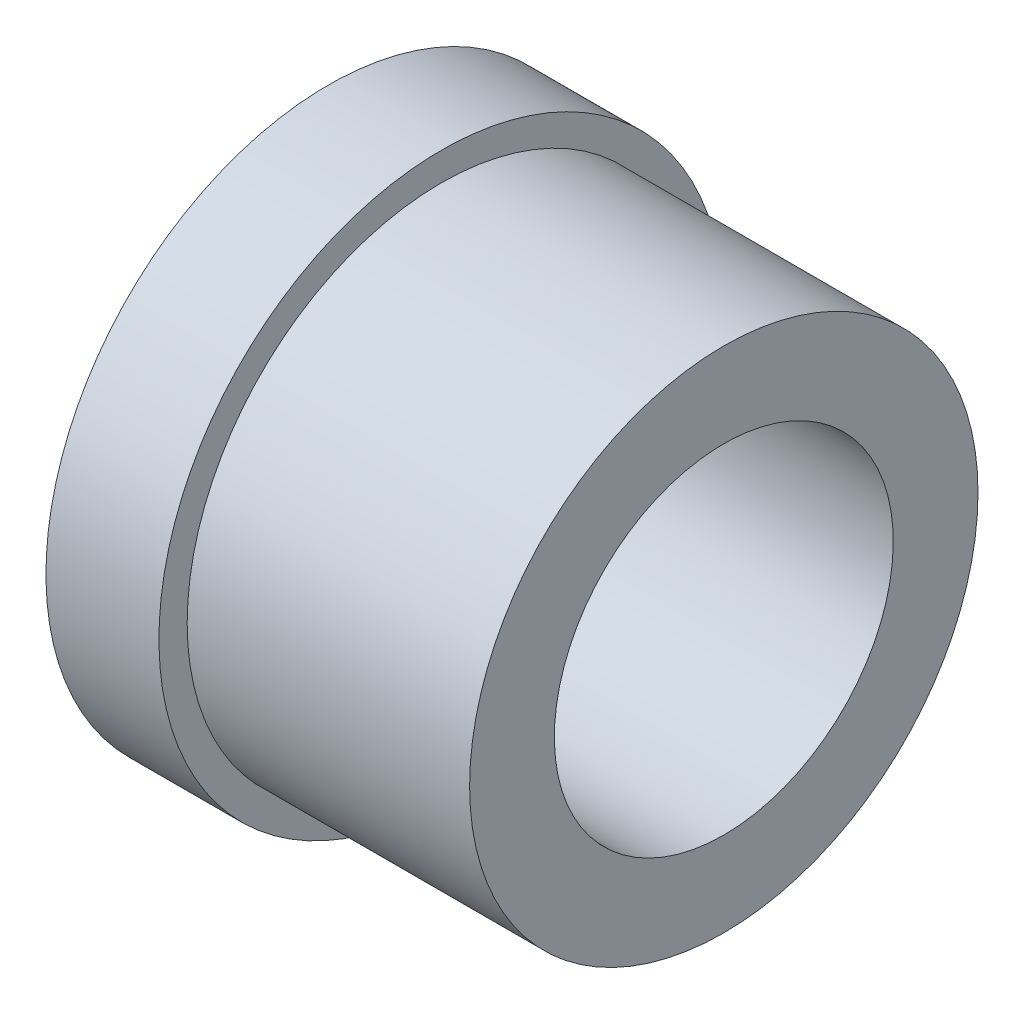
ISO-10303-21;
HEADER;
FILE_DESCRIPTION(('STEP AP214'),'2;1');
FILE_NAME('part.step','',(''),(''),'','','');
FILE_SCHEMA(('AUTOMOTIVE_DESIGN { 1 0 10303 214 1 1 1 1 }'));
ENDSEC;
DATA;
#1=APPLICATION_CONTEXT('core data for automotive mechanical design processes');
#2=APPLICATION_PROTOCOL_DEFINITION('international standard','automotive_design',2000,#1);
#3=PRODUCT_CONTEXT('',#1,'mechanical');
#4=PRODUCT('Part','Part','',(#3));
#5=PRODUCT_RELATED_PRODUCT_CATEGORY('part','',(#4));
#6=PRODUCT_DEFINITION_FORMATION('','',#4);
#7=PRODUCT_DEFINITION_CONTEXT('part definition',#1,'design');
#8=PRODUCT_DEFINITION('design','',#6,#7);
#9=PRODUCT_DEFINITION_SHAPE('','',#8);
#10=(LENGTH_UNIT() NAMED_UNIT(*) SI_UNIT(.MILLI.,.METRE.));
#11=(NAMED_UNIT(*) PLANE_ANGLE_UNIT() SI_UNIT($,.RADIAN.));
#12=(NAMED_UNIT(*) SI_UNIT($,.STERADIAN.) SOLID_ANGLE_UNIT());
#13=UNCERTAINTY_MEASURE_WITH_UNIT(LENGTH_MEASURE(1.E-05),#10,'distance_accuracy_value','');
#14=(GEOMETRIC_REPRESENTATION_CONTEXT(3) GLOBAL_UNCERTAINTY_ASSIGNED_CONTEXT((#13)) GLOBAL_UNIT_ASSIGNED_CONTEXT((#10,
#11,#12)) REPRESENTATION_CONTEXT('',''));
#15=CARTESIAN_POINT('',(0.,0.,0.));
#16=DIRECTION('',(0.,0.,1.));
#17=DIRECTION('',(1.,0.,0.));
#18=AXIS2_PLACEMENT_3D('',#15,#16,#17);
#19=CARTESIAN_POINT('',(-88.688569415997,0.,0.));
#20=DIRECTION('',(-1.,0.,0.));
#21=DIRECTION('',(0.,-1.,0.));
#22=AXIS2_PLACEMENT_3D('',#19,#20,#21);
#23=CYLINDRICAL_SURFACE('',#22,5.);
#24=CARTESIAN_POINT('',(-70.,0.,0.));
#25=DIRECTION('',(-1.,0.,0.));
#26=DIRECTION('',(0.,-1.,0.));
#27=AXIS2_PLACEMENT_3D('',#24,#25,#26);
#28=CIRCLE('',#27,5.);
#29=CARTESIAN_POINT('',(-70.,-5.,0.));
#30=VERTEX_POINT('',#29);
#31=EDGE_CURVE('E10',#30,#30,#28,.T.);
#32=ORIENTED_EDGE('',*,*,#31,.F.);
#33=EDGE_LOOP('',(#32));
#34=FACE_BOUND('',#33,.T.);
#35=CARTESIAN_POINT('',(-68.,0.,0.));
#36=DIRECTION('',(-1.,0.,0.));
#37=DIRECTION('',(0.,-1.,0.));
#38=AXIS2_PLACEMENT_3D('',#35,#36,#37);
#39=CIRCLE('',#38,5.);
#40=CARTESIAN_POINT('',(-68.,-5.,0.));
#41=VERTEX_POINT('',#40);
#42=EDGE_CURVE('E51',#41,#41,#39,.T.);
#43=ORIENTED_EDGE('',*,*,#42,.T.);
#44=EDGE_LOOP('',(#43));
#45=FACE_BOUND('',#44,.T.);
#46=ADVANCED_FACE('F29',(#34,#45),#23,.T.);
#47=CARTESIAN_POINT('',(-70.,5.,0.));
#48=DIRECTION('',(1.,0.,0.));
#49=DIRECTION('',(0.,1.,0.));
#50=AXIS2_PLACEMENT_3D('',#47,#48,#49);
#51=PLANE('',#50);
#52=CARTESIAN_POINT('',(-70.,0.,0.));
#53=DIRECTION('',(-1.,0.,0.));
#54=DIRECTION('',(0.,-1.,0.));
#55=AXIS2_PLACEMENT_3D('',#52,#53,#54);
#56=CIRCLE('',#55,2.99999999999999);
#57=CARTESIAN_POINT('',(-70.,-2.99999999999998,0.));
#58=VERTEX_POINT('',#57);
#59=EDGE_CURVE('E35',#58,#58,#56,.T.);
#60=ORIENTED_EDGE('',*,*,#59,.F.);
#61=EDGE_LOOP('',(#60));
#62=FACE_BOUND('',#61,.T.);
#63=ORIENTED_EDGE('',*,*,#31,.T.);
#64=EDGE_LOOP('',(#63));
#65=FACE_BOUND('',#64,.T.);
#66=ADVANCED_FACE('F76',(#62,#65),#51,.F.);
#67=CARTESIAN_POINT('',(-88.688569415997,0.,0.));
#68=DIRECTION('',(-1.,0.,0.));
#69=DIRECTION('',(0.,-1.,0.));
#70=AXIS2_PLACEMENT_3D('',#67,#68,#69);
#71=CYLINDRICAL_SURFACE('',#70,2.99999999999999);
#72=CARTESIAN_POINT('',(-63.,0.,0.));
#73=DIRECTION('',(-1.,0.,0.));
#74=DIRECTION('',(0.,-1.,0.));
#75=AXIS2_PLACEMENT_3D('',#72,#73,#74);
#76=CIRCLE('',#75,2.99999999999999);
#77=CARTESIAN_POINT('',(-63.,-2.99999999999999,0.));
#78=VERTEX_POINT('',#77);
#79=EDGE_CURVE('E39',#78,#78,#76,.T.);
#80=ORIENTED_EDGE('',*,*,#79,.F.);
#81=EDGE_LOOP('',(#80));
#82=FACE_BOUND('',#81,.T.);
#83=ORIENTED_EDGE('',*,*,#59,.T.);
#84=EDGE_LOOP('',(#83));
#85=FACE_BOUND('',#84,.T.);
#86=ADVANCED_FACE('F71',(#82,#85),#71,.F.);
#87=CARTESIAN_POINT('',(-63.,2.99999999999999,0.));
#88=DIRECTION('',(-1.,0.,0.));
#89=DIRECTION('',(0.,-1.,0.));
#90=AXIS2_PLACEMENT_3D('',#87,#88,#89);
#91=PLANE('',#90);
#92=CARTESIAN_POINT('',(-63.,0.,0.));
#93=DIRECTION('',(-1.,0.,0.));
#94=DIRECTION('',(0.,-1.,0.));
#95=AXIS2_PLACEMENT_3D('',#92,#93,#94);
#96=CIRCLE('',#95,4.49999999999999);
#97=CARTESIAN_POINT('',(-63.,-4.49999999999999,0.));
#98=VERTEX_POINT('',#97);
#99=EDGE_CURVE('E43',#98,#98,#96,.T.);
#100=ORIENTED_EDGE('',*,*,#99,.F.);
#101=EDGE_LOOP('',(#100));
#102=FACE_BOUND('',#101,.T.);
#103=ORIENTED_EDGE('',*,*,#79,.T.);
#104=EDGE_LOOP('',(#103));
#105=FACE_BOUND('',#104,.T.);
#106=ADVANCED_FACE('F65',(#102,#105),#91,.F.);
#107=CARTESIAN_POINT('',(-88.688569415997,0.,0.));
#108=DIRECTION('',(-1.,0.,0.));
#109=DIRECTION('',(0.,-1.,0.));
#110=AXIS2_PLACEMENT_3D('',#107,#108,#109);
#111=CYLINDRICAL_SURFACE('',#110,4.49999999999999);
#112=CARTESIAN_POINT('',(-68.,0.,0.));
#113=DIRECTION('',(-1.,0.,0.));
#114=DIRECTION('',(0.,-1.,0.));
#115=AXIS2_PLACEMENT_3D('',#112,#113,#114);
#116=CIRCLE('',#115,4.49999999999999);
#117=CARTESIAN_POINT('',(-68.,-4.49999999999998,0.));
#118=VERTEX_POINT('',#117);
#119=EDGE_CURVE('E48',#118,#118,#116,.T.);
#120=ORIENTED_EDGE('',*,*,#119,.F.);
#121=EDGE_LOOP('',(#120));
#122=FACE_BOUND('',#121,.T.);
#123=ORIENTED_EDGE('',*,*,#99,.T.);
#124=EDGE_LOOP('',(#123));
#125=FACE_BOUND('',#124,.T.);
#126=ADVANCED_FACE('F59',(#122,#125),#111,.T.);
#127=CARTESIAN_POINT('',(-68.,4.49999999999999,0.));
#128=DIRECTION('',(-1.,0.,0.));
#129=DIRECTION('',(0.,-1.,0.));
#130=AXIS2_PLACEMENT_3D('',#127,#128,#129);
#131=PLANE('',#130);
#132=ORIENTED_EDGE('',*,*,#42,.F.);
#133=EDGE_LOOP('',(#132));
#134=FACE_BOUND('',#133,.T.);
#135=ORIENTED_EDGE('',*,*,#119,.T.);
#136=EDGE_LOOP('',(#135));
#137=FACE_BOUND('',#136,.T.);
#138=ADVANCED_FACE('F56',(#134,#137),#131,.F.);
#139=CLOSED_SHELL('',(#46,#66,#86,#106,#126,#138));
#140=MANIFOLD_SOLID_BREP('B2',#139);
#141=ADVANCED_BREP_SHAPE_REPRESENTATION('',(#18,#140),#14);
#142=SHAPE_DEFINITION_REPRESENTATION(#9,#141);
ENDSEC;
END-ISO-10303-21;
